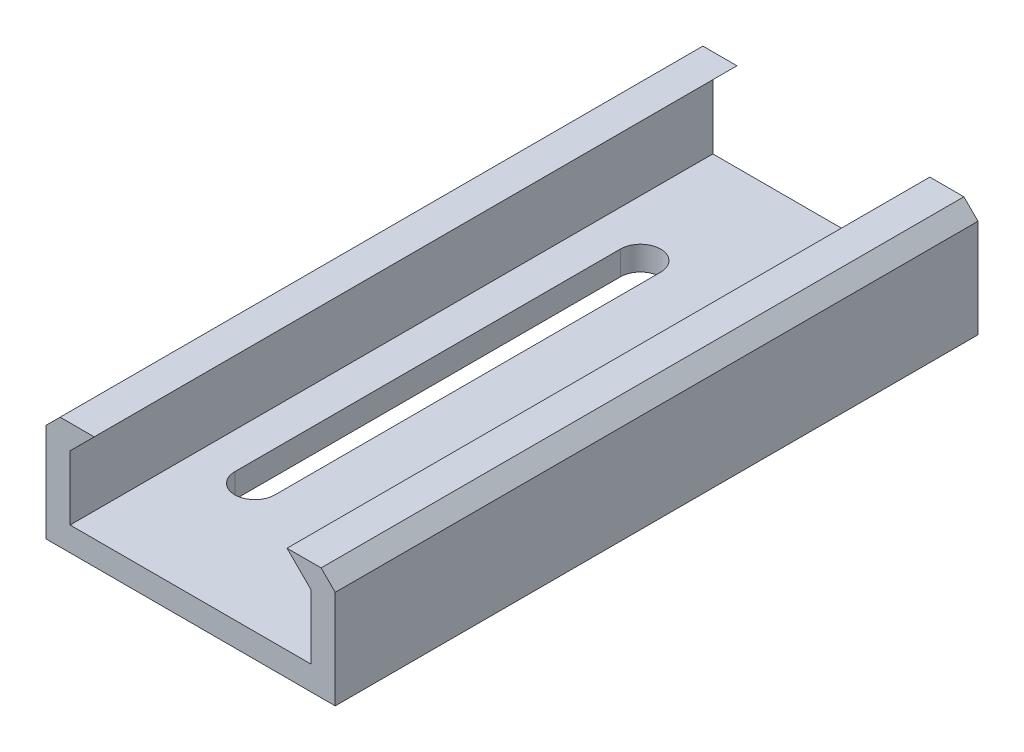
from build123d import *

# Parameters (mm, degrees)
BASE_EXTRUDE_DEPTH = 254
CUT_EXTRUDE1_DEPTH = 318.234084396


with BuildPart() as part:
    # Sketch1 → Base-Extrude (new body)
    with BuildSketch(Plane.XY):
        Polygon((-47.625, 25.4), (-38.1, 34.925), (-51.570384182, 34.925), (-57.15, 29.345384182), (-57.15, -9.525), (57.15, -9.525), (57.15, 29.345384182), (51.570384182, 34.925), (38.1, 34.925), (47.625, 25.4), (47.625, 0), (-47.625, 0), align=None)
    extrude(amount=-BASE_EXTRUDE_DEPTH)

    # Sketch2 → Cut-Extrude1 (cut, through all)
    with BuildSketch(Plane(origin=(-17.37237192, -9.525, 51.136162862), x_dir=(0, 0, 1), z_dir=(0, -1, 0))):
        with BuildLine():
            Line((-254.336162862, -34.83487192), (-101.936162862, -34.83487192))
            ThreePointArc((-101.936162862, -34.83487192), (-93.998662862, -42.77237192), (-101.936162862, -50.70987192))
            Line((-101.936162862, -50.70987192), (-254.336162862, -50.70987192))
            ThreePointArc((-254.336162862, -50.70987192), (-262.273662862, -42.77237192), (-254.336162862, -34.83487192))
        make_face()
        with BuildLine():
            Line((-254.336162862, 0.09012808), (-101.936162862, 0.09012808))
            ThreePointArc((-101.936162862, 0.09012808), (-93.998662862, 8.02762808), (-101.936162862, 15.96512808))
            Line((-101.936162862, 15.96512808), (-254.336162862, 15.96512808))
            ThreePointArc((-254.336162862, 15.96512808), (-262.273662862, 8.02762808), (-254.336162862, 0.09012808))
        make_face()
    extrude(amount=-CUT_EXTRUDE1_DEPTH, mode=Mode.SUBTRACT)


solid = part.part
